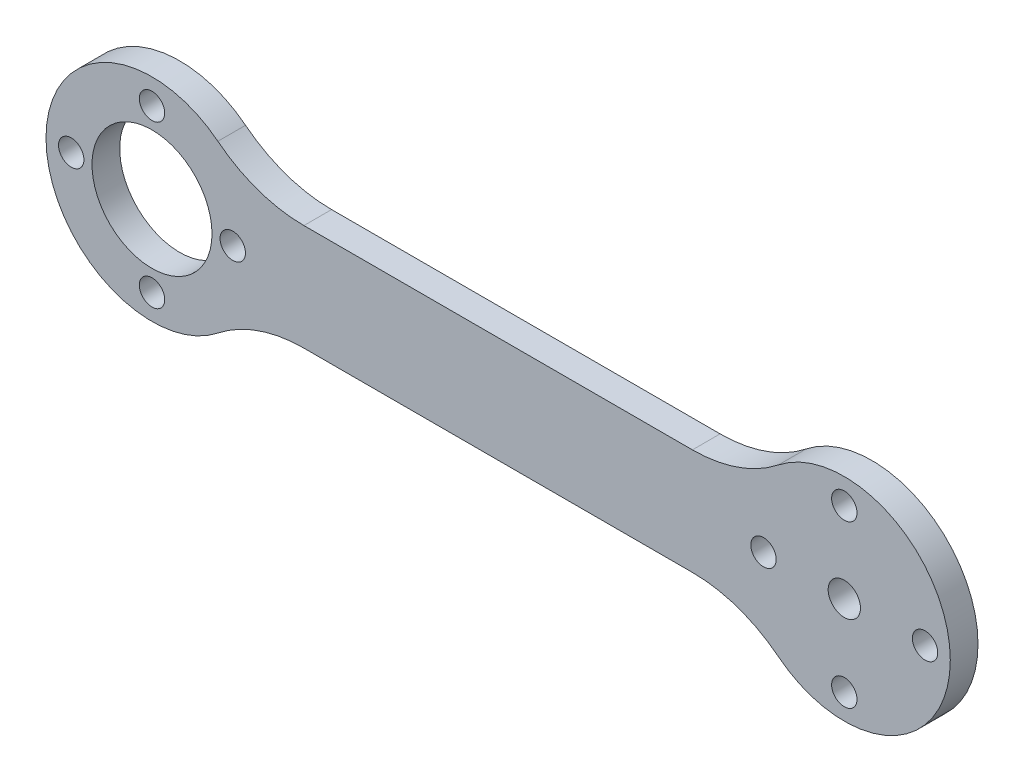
from build123d import *

# Parameters (mm, degrees)
SKETCH1_R           = 13
SKETCH1_R_2         = 2.75
SKETCH1_R_3         = 3.5
BOSS_EXTRUDE1_DEPTH = 6


with BuildPart() as part:
    # Sketch1 → Boss-Extrude1 (new body)
    with BuildSketch(Plane.XY):
        with BuildLine():
            Line((-42.088112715, 11.5), (42.088112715, 11.5))
            ThreePointArc((42.088112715, 11.5), (51.958176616, 13.170124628), (60.729291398, 17.994544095))
            ThreePointArc((60.729291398, 17.994544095), (69.667937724, 22.338886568), (79.605077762, 22.5))
            ThreePointArc((79.605077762, 22.5), (92.793522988, 14.520581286), (97.966426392, 0))
            ThreePointArc((97.966426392, 0), (95.497873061, -10.358278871), (88.622879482, -18.489832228))
            ThreePointArc((88.622879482, -18.489832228), (84.331932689, -20.985036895), (79.605077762, -22.5))
            ThreePointArc((79.605077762, -22.5), (69.667937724, -22.338886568), (60.729291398, -17.994544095))
            ThreePointArc((60.729291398, -17.994544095), (51.958176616, -13.170124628), (42.088112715, -11.5))
            Line((42.088112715, -11.5), (-42.088112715, -11.5))
            ThreePointArc((-42.088112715, -11.5), (-51.958176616, -13.170124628), (-60.729291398, -17.994544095))
            ThreePointArc((-60.729291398, -17.994544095), (-97.966426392, 0), (-60.729291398, 17.994544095))
            ThreePointArc((-60.729291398, 17.994544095), (-51.958176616, 13.170124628), (-42.088112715, 11.5))
        make_face()
        with Locations((-75, 0)):
            Circle(SKETCH1_R, mode=Mode.SUBTRACT)
        with Locations((-75, 17.5)):
            Circle(SKETCH1_R_2, mode=Mode.SUBTRACT)
        with Locations((-57.5, 0)):
            Circle(SKETCH1_R_2, mode=Mode.SUBTRACT)
        with Locations((-75, -17.5)):
            Circle(SKETCH1_R_2, mode=Mode.SUBTRACT)
        with Locations((-92.5, 0)):
            Circle(SKETCH1_R_2, mode=Mode.SUBTRACT)
        with Locations(Location((57.5, 0, 0), (0, 0, 180))):
            Circle(SKETCH1_R_2, mode=Mode.SUBTRACT)
        with Locations(Location((75, -17.5, 0), (0, 0, 180))):
            Circle(SKETCH1_R_2, mode=Mode.SUBTRACT)
        with Locations(Location((92.5, 0, 0), (0, 0, 180))):
            Circle(SKETCH1_R_2, mode=Mode.SUBTRACT)
        with Locations(Location((75, 17.5, 0), (0, 0, 180))):
            Circle(SKETCH1_R_2, mode=Mode.SUBTRACT)
        with Locations((75, 0)):
            Circle(SKETCH1_R_3, mode=Mode.SUBTRACT)
    extrude(amount=BOSS_EXTRUDE1_DEPTH)


solid = part.part
